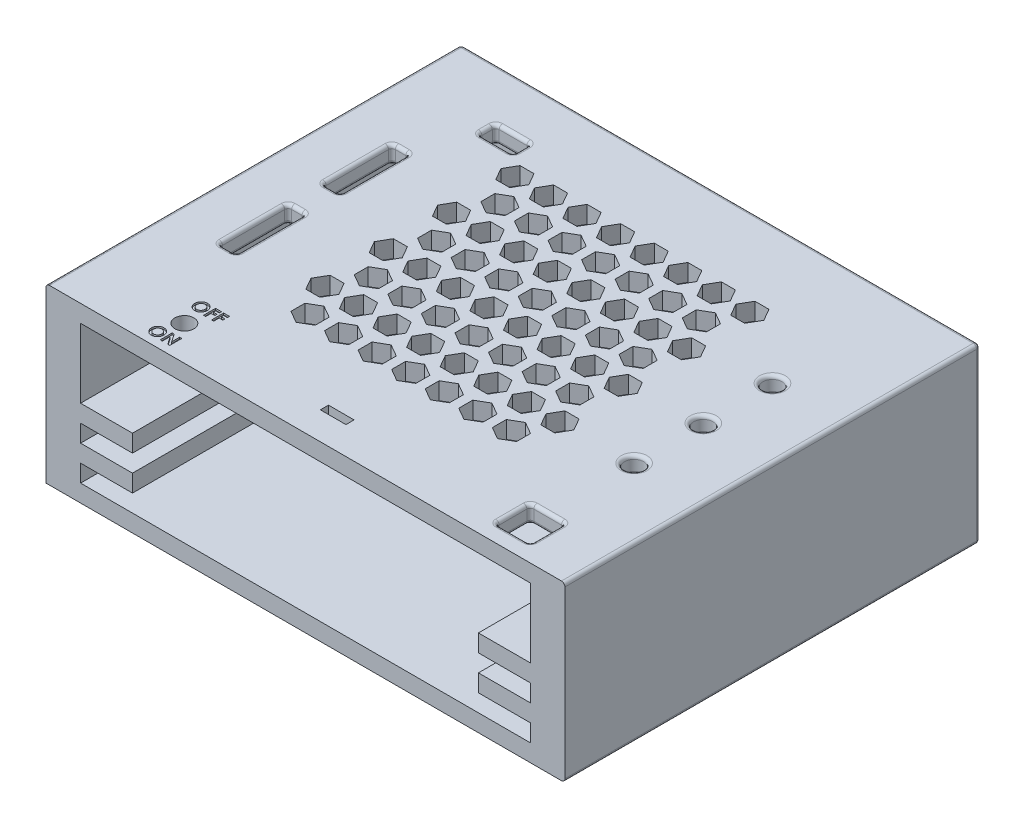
from build123d import *

# Parameters (mm, degrees)
SKETCH1_W           = 150
SKETCH1_H           = 120
BOSS_EXTRUDE1_DEPTH = 50
SKETCH8_W           = 130
SKETCH8_H           = 40
CUT_EXTRUDE5_DEPTH  = 110
BOSS_EXTRUDE2_REACH = 152.083
SKETCH3_W           = 15
SKETCH3_H           = 5
CUT_EXTRUDE1_REACH  = 110.282
SKETCH4_R           = 2.75
SKETCH4_W           = 5
SKETCH4_H           = 20
SKETCH4_W_2         = 10
SKETCH4_H_2         = 10
SKETCH4_W_3         = 7.4
SKETCH4_H_3         = 2.35
SKETCH4_H_4         = 5
CUT_EXTRUDE2_DEPTH  = 0.5
CUT_EXTRUDE3_DEPTH  = 0.5
CUT_EXTRUDE6_REACH  = 110.282
LPATTERN1_COUNT     = 4
LPATTERN1_PITCH     = 18.3
FILLET1_R           = 1


with BuildPart() as part:
    # Sketch1 → Boss-Extrude1 (new body)
    with BuildSketch(Plane(origin=(0, 0, 0), x_dir=(1, 0, 0), z_dir=(0, 1, 0))):
        Rectangle(SKETCH1_W, SKETCH1_H)
    extrude(amount=BOSS_EXTRUDE1_DEPTH)

    # Sketch8 → Cut-Extrude5 (cut)
    with BuildSketch(Plane.XY.offset(60)):
        with Locations((0, 25)):
            Rectangle(SKETCH8_W, SKETCH8_H)
    extrude(amount=-CUT_EXTRUDE5_DEPTH, mode=Mode.SUBTRACT)

    # Sketch3 → Boss-Extrude2 (add, up to next)
    with BuildSketch(Plane.XY.offset(60), mode=Mode.PRIVATE) as boss_extrude2_sk1:
        with Locations((57.5, 12.5)):
            Rectangle(SKETCH3_W, SKETCH3_H)
    boss_extrude2_tool1 = extrude(boss_extrude2_sk1.sketch, amount=-BOSS_EXTRUDE2_REACH, mode=Mode.PRIVATE) - part.part
    # Sketch3 → Boss-Extrude2 (add, up to next)
    with BuildSketch(Plane.XY.offset(60), mode=Mode.PRIVATE) as boss_extrude2_sk2:
        with Locations((-57.5, 22.5)):
            Rectangle(SKETCH3_W, SKETCH3_H)
    boss_extrude2_tool2 = extrude(boss_extrude2_sk2.sketch, amount=-BOSS_EXTRUDE2_REACH, mode=Mode.PRIVATE) - part.part
    # Sketch3 → Boss-Extrude2 (add, up to next)
    with BuildSketch(Plane.XY.offset(60), mode=Mode.PRIVATE) as boss_extrude2_sk3:
        with Locations((-57.5, 12.5)):
            Rectangle(SKETCH3_W, SKETCH3_H)
    boss_extrude2_tool3 = extrude(boss_extrude2_sk3.sketch, amount=-BOSS_EXTRUDE2_REACH, mode=Mode.PRIVATE) - part.part
    # Sketch3 → Boss-Extrude2 (add, up to next)
    with BuildSketch(Plane.XY.offset(60), mode=Mode.PRIVATE) as boss_extrude2_sk4:
        with Locations((57.5, 22.5)):
            Rectangle(SKETCH3_W, SKETCH3_H)
    boss_extrude2_tool4 = extrude(boss_extrude2_sk4.sketch, amount=-BOSS_EXTRUDE2_REACH, mode=Mode.PRIVATE) - part.part
    add(boss_extrude2_tool1.solids().sort_by_distance((57.5, 12.5, 60))[0])
    add(boss_extrude2_tool2.solids().sort_by_distance((-57.5, 22.5, 60))[0])
    add(boss_extrude2_tool3.solids().sort_by_distance((-57.5, 12.5, 60))[0])
    add(boss_extrude2_tool4.solids().sort_by_distance((57.5, 22.5, 60))[0])

    # Sketch4 → Cut-Extrude1 (cut, up to next)
    with BuildSketch(Plane(origin=(0, 50, 0), x_dir=(1, 0, 0), z_dir=(0, 1, 0)), mode=Mode.PRIVATE) as cut_extrude1_sk1:
        with Locations(Location((-45, -50, 0), (0, 0, 270))):
            Circle(SKETCH4_R)
    cut_extrude1_tool1 = extrude(cut_extrude1_sk1.sketch, amount=-CUT_EXTRUDE1_REACH, mode=Mode.PRIVATE) & part.part
    # Sketch4 → Cut-Extrude1 (cut, up to next)
    with BuildSketch(Plane(origin=(0, 50, 0), x_dir=(1, 0, 0), z_dir=(0, 1, 0)), mode=Mode.PRIVATE) as cut_extrude1_sk2:
        with Locations(Location((55, 0, 0), (0, 0, 270))):
            Circle(SKETCH4_R)
    cut_extrude1_tool2 = extrude(cut_extrude1_sk2.sketch, amount=-CUT_EXTRUDE1_REACH, mode=Mode.PRIVATE) & part.part
    # Sketch4 → Cut-Extrude1 (cut, up to next)
    with BuildSketch(Plane(origin=(0, 50, 0), x_dir=(1, 0, 0), z_dir=(0, 1, 0)), mode=Mode.PRIVATE) as cut_extrude1_sk3:
        with Locations(Location((55, -20, 0), (0, 0, 270))):
            Circle(SKETCH4_R)
    cut_extrude1_tool3 = extrude(cut_extrude1_sk3.sketch, amount=-CUT_EXTRUDE1_REACH, mode=Mode.PRIVATE) & part.part
    # Sketch4 → Cut-Extrude1 (cut, up to next)
    with BuildSketch(Plane(origin=(0, 50, 0), x_dir=(1, 0, 0), z_dir=(0, 1, 0)), mode=Mode.PRIVATE) as cut_extrude1_sk4:
        with Locations(Location((55, 20, 0), (0, 0, 270))):
            Circle(SKETCH4_R)
    cut_extrude1_tool4 = extrude(cut_extrude1_sk4.sketch, amount=-CUT_EXTRUDE1_REACH, mode=Mode.PRIVATE) & part.part
    # Sketch4 → Cut-Extrude1 (cut, up to next)
    with BuildSketch(Plane(origin=(0, 50, 0), x_dir=(1, 0, 0), z_dir=(0, 1, 0)), mode=Mode.PRIVATE) as cut_extrude1_sk5:
        with Locations((-57.5, 15)):
            Rectangle(SKETCH4_W, SKETCH4_H)
    cut_extrude1_tool5 = extrude(cut_extrude1_sk5.sketch, amount=-CUT_EXTRUDE1_REACH, mode=Mode.PRIVATE) & part.part
    # Sketch4 → Cut-Extrude1 (cut, up to next)
    with BuildSketch(Plane(origin=(0, 50, 0), x_dir=(1, 0, 0), z_dir=(0, 1, 0)), mode=Mode.PRIVATE) as cut_extrude1_sk6:
        with Locations((55, -50)):
            Rectangle(SKETCH4_W_2, SKETCH4_H_2)
    cut_extrude1_tool6 = extrude(cut_extrude1_sk6.sketch, amount=-CUT_EXTRUDE1_REACH, mode=Mode.PRIVATE) & part.part
    # Sketch4 → Cut-Extrude1 (cut, up to next)
    with BuildSketch(Plane(origin=(0, 50, 0), x_dir=(1, 0, 0), z_dir=(0, 1, 0)), mode=Mode.PRIVATE) as cut_extrude1_sk7:
        with Locations((0, -50.825)):
            Rectangle(SKETCH4_W_3, SKETCH4_H_3)
    cut_extrude1_tool7 = extrude(cut_extrude1_sk7.sketch, amount=-CUT_EXTRUDE1_REACH, mode=Mode.PRIVATE) & part.part
    # Sketch4 → Cut-Extrude1 (cut, up to next)
    with BuildSketch(Plane(origin=(0, 50, 0), x_dir=(1, 0, 0), z_dir=(0, 1, 0)), mode=Mode.PRIVATE) as cut_extrude1_sk8:
        with Locations((-57.5, -15)):
            Rectangle(SKETCH4_W, SKETCH4_H)
    cut_extrude1_tool8 = extrude(cut_extrude1_sk8.sketch, amount=-CUT_EXTRUDE1_REACH, mode=Mode.PRIVATE) & part.part
    # Sketch4 → Cut-Extrude1 (cut, up to next)
    with BuildSketch(Plane(origin=(0, 50, 0), x_dir=(1, 0, 0), z_dir=(0, 1, 0)), mode=Mode.PRIVATE) as cut_extrude1_sk9:
        with Locations((-45, 42.5)):
            Rectangle(SKETCH4_W_2, SKETCH4_H_4)
    cut_extrude1_tool9 = extrude(cut_extrude1_sk9.sketch, amount=-CUT_EXTRUDE1_REACH, mode=Mode.PRIVATE) & part.part
    add(cut_extrude1_tool1.solids().sort_by_distance((-45, 50, 50))[0], mode=Mode.SUBTRACT)
    add(cut_extrude1_tool2.solids().sort_by_distance((55, 50, 0))[0], mode=Mode.SUBTRACT)
    add(cut_extrude1_tool3.solids().sort_by_distance((55, 50, 20))[0], mode=Mode.SUBTRACT)
    add(cut_extrude1_tool4.solids().sort_by_distance((55, 50, -20))[0], mode=Mode.SUBTRACT)
    add(cut_extrude1_tool5.solids().sort_by_distance((-57.5, 50, -15))[0], mode=Mode.SUBTRACT)
    add(cut_extrude1_tool6.solids().sort_by_distance((55, 50, 50))[0], mode=Mode.SUBTRACT)
    add(cut_extrude1_tool7.solids().sort_by_distance((0, 50, 50.825))[0], mode=Mode.SUBTRACT)
    add(cut_extrude1_tool8.solids().sort_by_distance((-57.5, 50, 15))[0], mode=Mode.SUBTRACT)
    add(cut_extrude1_tool9.solids().sort_by_distance((-45, 50, -42.5))[0], mode=Mode.SUBTRACT)

    # Sketch5 → Cut-Extrude2 (cut)
    # profile 1 of 2: a face of its own
    with BuildSketch(Plane(origin=(0, 50, 0), x_dir=(1, 0, 0), z_dir=(0, 1, 0))):
        with BuildLine():
            add(Edge.make_bspline(
                [(-46.80393132, -54.056589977), (-46.74307953, -54.058165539), (-46.622944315, -54.061276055), (-46.446268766, -54.087204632), (-46.276009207, -54.129451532), (-46.11224263, -54.188177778), (-45.955379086, -54.264973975), (-45.804865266, -54.357662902), (-45.661240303, -54.467994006), (-45.525975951, -54.593393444), (-45.400967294, -54.729759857), (-45.29264722, -54.876582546), (-45.200275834, -55.030057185), (-45.123718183, -55.190595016), (-45.065405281, -55.359307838), (-45.024484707, -55.535335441), (-44.998195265, -55.718627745), (-44.995171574, -55.843424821), (-44.993634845, -55.906850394)],
                knots=[0, 0, 0, 0, 1.014329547, 2.002516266, 2.970391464, 3.935626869, 4.897733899, 5.877609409, 6.878433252, 7.912639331, 8.949961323, 9.958554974, 10.949718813, 11.932905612, 12.9188844, 13.919928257, 14.942845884, 16, 16, 16, 16], degree=3))
            add(Edge.make_bspline(
                [(-44.993634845, -55.906850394), (-44.995271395, -55.969561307), (-44.998496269, -56.093135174), (-45.023411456, -56.274738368), (-45.065021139, -56.448880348), (-45.122345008, -56.615955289), (-45.197514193, -56.775153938), (-45.288084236, -56.927492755), (-45.396445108, -57.071558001), (-45.518644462, -57.207272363), (-45.653175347, -57.330462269), (-45.79566491, -57.43902316), (-45.945455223, -57.531013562), (-46.102327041, -57.60639134), (-46.266616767, -57.664889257), (-46.437918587, -57.706163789), (-46.616221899, -57.731247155), (-46.737476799, -57.734450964), (-46.799023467, -57.736077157)],
                knots=[0, 0, 0, 0, 1.051557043, 2.072126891, 3.067553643, 4.050577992, 5.02905126, 6.015227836, 7.017913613, 8.04756643, 9.074058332, 10.072836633, 11.047628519, 12.017157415, 12.98668631, 13.966869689, 14.968021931, 16, 16, 16, 16], degree=3))
            add(Edge.make_bspline(
                [(-46.799023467, -57.736077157), (-46.863393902, -57.734618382), (-46.989873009, -57.731752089), (-47.174975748, -57.704494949), (-47.352320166, -57.663436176), (-47.520416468, -57.602158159), (-47.680976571, -57.525555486), (-47.832820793, -57.4312147), (-47.975898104, -57.319291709), (-48.10938779, -57.192652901), (-48.230329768, -57.054082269), (-48.337084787, -56.907694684), (-48.427135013, -56.75460842), (-48.500483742, -56.594751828), (-48.558308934, -56.429118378), (-48.599098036, -56.256699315), (-48.623193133, -56.077908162), (-48.62654944, -55.956469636), (-48.62825023, -55.894931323)],
                knots=[0, 0, 0, 0, 1.067978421, 2.098431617, 3.099715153, 4.085208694, 5.062210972, 6.048429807, 7.046490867, 8.072918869, 9.098532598, 10.095778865, 11.076610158, 12.041847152, 13.011192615, 13.984257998, 14.978533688, 16, 16, 16, 16], degree=3))
            add(Edge.make_bspline(
                [(-48.62825023, -55.894931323), (-48.627716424, -55.853531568), (-48.626655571, -55.771256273), (-48.613876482, -55.649328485), (-48.595478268, -55.529780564), (-48.568268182, -55.413089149), (-48.535214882, -55.298431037), (-48.492389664, -55.186873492), (-48.443642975, -55.077224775), (-48.386687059, -54.970779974), (-48.323357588, -54.86851847), (-48.254259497, -54.770922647), (-48.179219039, -54.679172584), (-48.098477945, -54.592665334), (-48.011757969, -54.511969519), (-47.920199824, -54.435942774), (-47.822027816, -54.366604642), (-47.71939062, -54.302261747), (-47.612866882, -54.244077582), (-47.50289025, -54.194552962), (-47.39172646, -54.151303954), (-47.277890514, -54.117169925), (-47.162602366, -54.089368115), (-47.044630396, -54.070982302), (-46.925040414, -54.058203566), (-46.844396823, -54.057129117), (-46.80393132, -54.056589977)],
                knots=[0, 0, 0, 0, 1.034744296, 2.056386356, 3.06226378, 4.057406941, 5.050368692, 6.043467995, 7.042652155, 8.049140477, 9.059438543, 10.048523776, 11.036952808, 12.020949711, 13.004946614, 13.997082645, 14.994316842, 16.007702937, 17.024872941, 18.026463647, 19.021641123, 20.005082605, 20.995858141, 21.984425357, 22.988620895, 24, 24, 24, 24], degree=3))
        make_face()
        with BuildLine():
            add(Edge.make_bspline(
                [(-46.813747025, -54.684795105), (-46.854700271, -54.685893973), (-46.935525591, -54.688062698), (-47.054081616, -54.704585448), (-47.167899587, -54.730974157), (-47.276348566, -54.76919788), (-47.379898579, -54.817846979), (-47.47873319, -54.876751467), (-47.571483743, -54.94793612), (-47.659386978, -55.027579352), (-47.738793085, -55.116320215), (-47.808950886, -55.211421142), (-47.867661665, -55.312723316), (-47.916832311, -55.419285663), (-47.953846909, -55.532306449), (-47.980211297, -55.65090037), (-47.996872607, -55.775271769), (-47.998972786, -55.860055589), (-48.000045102, -55.903344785)],
                knots=[0, 0, 0, 0, 1.033739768, 2.040188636, 3.016340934, 3.979330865, 4.937572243, 5.900995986, 6.878200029, 7.884839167, 8.891893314, 9.879764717, 10.863503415, 11.843163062, 12.837761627, 13.859916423, 14.907309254, 16, 16, 16, 16], degree=3))
            add(Edge.make_bspline(
                [(-48.000045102, -55.903344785), (-47.998623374, -55.951318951), (-47.995837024, -56.045340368), (-47.976231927, -56.182496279), (-47.942689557, -56.312026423), (-47.894255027, -56.433297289), (-47.834183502, -56.547655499), (-47.759584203, -56.653699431), (-47.671665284, -56.752064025), (-47.603933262, -56.809493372), (-47.56955632, -56.838641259)],
                knots=[0, 0, 0, 0, 1.078454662, 2.113592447, 3.107694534, 4.079536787, 5.043276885, 6.005368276, 6.987637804, 8, 8, 8, 8], degree=3))
            add(Edge.make_bspline(
                [(-47.56955632, -56.838641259), (-47.541395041, -56.860174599), (-47.485706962, -56.902756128), (-47.396816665, -56.957333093), (-47.305277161, -57.004110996), (-47.210397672, -57.041906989), (-47.112378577, -57.071636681), (-47.011233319, -57.092455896), (-46.90710521, -57.105521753), (-46.836688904, -57.107083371), (-46.801126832, -57.107872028)],
                knots=[0, 0, 0, 0, 1.023928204, 2.024787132, 3.009472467, 3.9914905, 4.972207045, 5.96565515, 6.972602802, 8, 8, 8, 8], degree=3))
            add(Edge.make_bspline(
                [(-46.801126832, -57.107872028), (-46.760877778, -57.106763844), (-46.681686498, -57.104583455), (-46.565337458, -57.08826411), (-46.453871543, -57.060645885), (-46.346596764, -57.022757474), (-46.243822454, -56.973497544), (-46.146050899, -56.912766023), (-46.053110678, -56.841308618), (-45.965319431, -56.760619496), (-45.885074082, -56.671529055), (-45.815062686, -56.575920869), (-45.754485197, -56.475901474), (-45.706337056, -56.370055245), (-45.667860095, -56.259381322), (-45.641813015, -56.143389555), (-45.625010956, -56.022558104), (-45.622910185, -55.940328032), (-45.621839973, -55.898436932)],
                knots=[0, 0, 0, 0, 1.026359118, 2.019393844, 2.989460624, 3.950973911, 4.916101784, 5.890408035, 6.881132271, 7.902007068, 8.92769091, 9.933912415, 10.920395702, 11.90457117, 12.894218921, 13.903490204, 14.931958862, 16, 16, 16, 16], degree=3))
            add(Edge.make_bspline(
                [(-45.621839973, -55.898436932), (-45.622947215, -55.856786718), (-45.62512665, -55.774804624), (-45.641474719, -55.654283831), (-45.668917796, -55.538804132), (-45.706919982, -55.42817694), (-45.755446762, -55.322293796), (-45.815455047, -55.22152705), (-45.886734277, -55.125974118), (-45.967643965, -55.036286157), (-46.055709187, -54.953868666), (-46.150256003, -54.882345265), (-46.248638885, -54.820193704), (-46.353115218, -54.771506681), (-46.461547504, -54.732717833), (-46.574597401, -54.704153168), (-46.692693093, -54.688178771), (-46.773036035, -54.685933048), (-46.813747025, -54.684795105)],
                knots=[0, 0, 0, 0, 1.055025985, 2.07665775, 3.074803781, 4.057872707, 5.035505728, 6.020516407, 7.023567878, 8.050795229, 9.077271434, 10.074415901, 11.050397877, 12.019801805, 12.988065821, 13.964604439, 14.968634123, 16, 16, 16, 16], degree=3))
        make_face(mode=Mode.SUBTRACT)
    # profile 2 of 2: a face of its own
    with BuildSketch(Plane(origin=(0, 50, 0), x_dir=(1, 0, 0), z_dir=(0, 1, 0))):
        Polygon((-44.365429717, -54.146333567), (-43.799624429, -54.146333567), (-42.211583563, -56.449518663), (-42.211583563, -54.146333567), (-41.583378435, -54.146333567), (-41.583378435, -57.646333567), (-42.153390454, -57.646333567), (-43.737224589, -55.350159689), (-43.737224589, -57.646333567), (-44.365429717, -57.646333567), align=None)
    extrude(amount=-CUT_EXTRUDE2_DEPTH, mode=Mode.SUBTRACT)

    # Sketch6 → Cut-Extrude3 (cut)
    # profile 1 of 3: a face of its own
    with BuildSketch(Plane(origin=(0, 50, 0), x_dir=(1, 0, 0), z_dir=(0, 1, 0))):
        with BuildLine():
            add(Edge.make_bspline(
                [(-46.689313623, -41.639672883), (-46.628461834, -41.641248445), (-46.508326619, -41.64435896), (-46.33165107, -41.670287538), (-46.161391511, -41.712534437), (-45.997624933, -41.771260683), (-45.84076139, -41.848056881), (-45.69024757, -41.940745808), (-45.546622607, -42.051076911), (-45.411358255, -42.17647635), (-45.286349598, -42.312842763), (-45.178029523, -42.459665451), (-45.085658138, -42.613140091), (-45.009100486, -42.773677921), (-44.950787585, -42.942390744), (-44.90986701, -43.118418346), (-44.883577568, -43.30171065), (-44.880553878, -43.426507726), (-44.879017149, -43.489933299)],
                knots=[0, 0, 0, 0, 1.014329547, 2.002516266, 2.970391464, 3.935626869, 4.897733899, 5.877609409, 6.878433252, 7.912639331, 8.949961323, 9.958554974, 10.949718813, 11.932905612, 12.9188844, 13.919928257, 14.942845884, 16, 16, 16, 16], degree=3))
            add(Edge.make_bspline(
                [(-44.879017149, -43.489933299), (-44.880653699, -43.552644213), (-44.883878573, -43.67621808), (-44.90879376, -43.857821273), (-44.950403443, -44.031963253), (-45.007727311, -44.199038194), (-45.082896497, -44.358236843), (-45.173466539, -44.510575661), (-45.281827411, -44.654640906), (-45.404026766, -44.790355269), (-45.53855765, -44.913545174), (-45.681047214, -45.022106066), (-45.830837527, -45.114096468), (-45.987709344, -45.189474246), (-46.151999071, -45.247972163), (-46.323300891, -45.289246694), (-46.501604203, -45.31433006), (-46.622859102, -45.31753387), (-46.684405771, -45.319160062)],
                knots=[0, 0, 0, 0, 1.051557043, 2.072126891, 3.067553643, 4.050577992, 5.02905126, 6.015227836, 7.017913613, 8.04756643, 9.074058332, 10.072836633, 11.047628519, 12.017157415, 12.98668631, 13.966869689, 14.968021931, 16, 16, 16, 16], degree=3))
            add(Edge.make_bspline(
                [(-46.684405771, -45.319160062), (-46.748776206, -45.317701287), (-46.875255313, -45.314834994), (-47.060358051, -45.287577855), (-47.237702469, -45.246519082), (-47.405798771, -45.185241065), (-47.566358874, -45.108638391), (-47.718203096, -45.014297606), (-47.861280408, -44.902374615), (-47.994770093, -44.775735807), (-48.115712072, -44.637165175), (-48.222467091, -44.49077759), (-48.312517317, -44.337691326), (-48.385866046, -44.177834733), (-48.443691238, -44.012201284), (-48.48448034, -43.83978222), (-48.508575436, -43.660991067), (-48.511931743, -43.539552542), (-48.513632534, -43.478014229)],
                knots=[0, 0, 0, 0, 1.067978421, 2.098431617, 3.099715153, 4.085208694, 5.062210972, 6.048429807, 7.046490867, 8.072918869, 9.098532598, 10.095778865, 11.076610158, 12.041847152, 13.011192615, 13.984257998, 14.978533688, 16, 16, 16, 16], degree=3))
            add(Edge.make_bspline(
                [(-48.513632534, -43.478014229), (-48.513098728, -43.436614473), (-48.512037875, -43.354339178), (-48.499258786, -43.232411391), (-48.480860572, -43.11286347), (-48.453650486, -42.996172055), (-48.420597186, -42.881513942), (-48.377771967, -42.769956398), (-48.329025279, -42.660307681), (-48.272069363, -42.55386288), (-48.208739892, -42.451601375), (-48.139641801, -42.354005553), (-48.064601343, -42.262255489), (-47.983860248, -42.17574824), (-47.897140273, -42.095052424), (-47.805582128, -42.01902568), (-47.707410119, -41.949687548), (-47.604772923, -41.885344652), (-47.498249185, -41.827160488), (-47.388272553, -41.777635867), (-47.277108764, -41.73438686), (-47.163272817, -41.700252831), (-47.04798467, -41.672451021), (-46.9300127, -41.654065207), (-46.810422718, -41.641286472), (-46.729779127, -41.640212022), (-46.689313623, -41.639672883)],
                knots=[0, 0, 0, 0, 1.034744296, 2.056386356, 3.06226378, 4.057406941, 5.050368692, 6.043467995, 7.042652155, 8.049140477, 9.059438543, 10.048523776, 11.036952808, 12.020949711, 13.004946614, 13.997082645, 14.994316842, 16.007702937, 17.024872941, 18.026463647, 19.021641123, 20.005082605, 20.995858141, 21.984425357, 22.988620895, 24, 24, 24, 24], degree=3))
        make_face()
        with BuildLine():
            add(Edge.make_bspline(
                [(-46.699129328, -42.267878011), (-46.740082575, -42.268976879), (-46.820907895, -42.271145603), (-46.93946392, -42.287668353), (-47.053281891, -42.314057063), (-47.161730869, -42.352280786), (-47.265280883, -42.400929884), (-47.364115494, -42.459834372), (-47.456866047, -42.531019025), (-47.544769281, -42.610662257), (-47.624175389, -42.69940312), (-47.69433319, -42.794504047), (-47.753043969, -42.895806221), (-47.802214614, -43.002368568), (-47.839229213, -43.115389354), (-47.865593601, -43.233983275), (-47.882254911, -43.358354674), (-47.884355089, -43.443138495), (-47.885427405, -43.486427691)],
                knots=[0, 0, 0, 0, 1.033739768, 2.040188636, 3.016340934, 3.979330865, 4.937572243, 5.900995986, 6.878200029, 7.884839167, 8.891893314, 9.879764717, 10.863503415, 11.843163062, 12.837761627, 13.859916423, 14.907309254, 16, 16, 16, 16], degree=3))
            add(Edge.make_bspline(
                [(-47.885427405, -43.486427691), (-47.884005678, -43.534401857), (-47.881219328, -43.628423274), (-47.861614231, -43.765579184), (-47.828071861, -43.895109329), (-47.779637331, -44.016380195), (-47.719565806, -44.130738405), (-47.644966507, -44.236782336), (-47.557047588, -44.33514693), (-47.489315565, -44.392576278), (-47.454938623, -44.421724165)],
                knots=[0, 0, 0, 0, 1.078454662, 2.113592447, 3.107694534, 4.079536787, 5.043276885, 6.005368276, 6.987637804, 8, 8, 8, 8], degree=3))
            add(Edge.make_bspline(
                [(-47.454938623, -44.421724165), (-47.426777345, -44.443257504), (-47.371089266, -44.485839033), (-47.282198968, -44.540415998), (-47.190659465, -44.587193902), (-47.095779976, -44.624989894), (-46.997760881, -44.654719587), (-46.896615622, -44.675538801), (-46.792487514, -44.688604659), (-46.722071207, -44.690166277), (-46.686509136, -44.690954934)],
                knots=[0, 0, 0, 0, 1.023928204, 2.024787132, 3.009472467, 3.9914905, 4.972207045, 5.96565515, 6.972602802, 8, 8, 8, 8], degree=3))
            add(Edge.make_bspline(
                [(-46.686509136, -44.690954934), (-46.646260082, -44.689846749), (-46.567068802, -44.687666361), (-46.450719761, -44.671347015), (-46.339253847, -44.64372879), (-46.231979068, -44.605840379), (-46.129204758, -44.556580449), (-46.031433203, -44.495848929), (-45.938492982, -44.424391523), (-45.850701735, -44.343702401), (-45.770456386, -44.25461196), (-45.70044499, -44.159003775), (-45.639867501, -44.058984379), (-45.59171936, -43.953138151), (-45.553242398, -43.842464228), (-45.527195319, -43.72647246), (-45.510393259, -43.60564101), (-45.508292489, -43.523410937), (-45.507222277, -43.481519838)],
                knots=[0, 0, 0, 0, 1.026359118, 2.019393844, 2.989460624, 3.950973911, 4.916101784, 5.890408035, 6.881132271, 7.902007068, 8.92769091, 9.933912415, 10.920395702, 11.90457117, 12.894218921, 13.903490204, 14.931958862, 16, 16, 16, 16], degree=3))
            add(Edge.make_bspline(
                [(-45.507222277, -43.481519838), (-45.508329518, -43.439869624), (-45.510508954, -43.35788753), (-45.526857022, -43.237366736), (-45.5543001, -43.121887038), (-45.592302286, -43.011259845), (-45.640829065, -42.905376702), (-45.700837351, -42.804609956), (-45.772116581, -42.709057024), (-45.853026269, -42.619369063), (-45.941091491, -42.536951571), (-46.035638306, -42.465428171), (-46.134021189, -42.40327661), (-46.238497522, -42.354589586), (-46.346929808, -42.315800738), (-46.459979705, -42.287236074), (-46.578075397, -42.271261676), (-46.658418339, -42.269015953), (-46.699129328, -42.267878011)],
                knots=[0, 0, 0, 0, 1.055025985, 2.07665775, 3.074803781, 4.057872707, 5.035505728, 6.020516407, 7.023567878, 8.050795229, 9.077271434, 10.074415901, 11.050397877, 12.019801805, 12.988065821, 13.964604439, 14.968634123, 16, 16, 16, 16], degree=3))
        make_face(mode=Mode.SUBTRACT)
    # profile 2 of 3: a face of its own
    with BuildSketch(Plane(origin=(0, 50, 0), x_dir=(1, 0, 0), z_dir=(0, 1, 0))):
        Polygon((-44.250812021, -41.729416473), (-42.545683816, -41.729416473), (-42.545683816, -42.357621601), (-43.622606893, -42.357621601), (-43.622606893, -43.030698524), (-42.545683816, -43.030698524), (-42.545683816, -43.658903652), (-43.622606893, -43.658903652), (-43.622606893, -45.229416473), (-44.250812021, -45.229416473), align=None)
    # profile 3 of 3: a face of its own
    with BuildSketch(Plane(origin=(0, 50, 0), x_dir=(1, 0, 0), z_dir=(0, 1, 0))):
        Polygon((-41.917478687, -41.729416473), (-40.212350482, -41.729416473), (-40.212350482, -42.357621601), (-41.289273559, -42.357621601), (-41.289273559, -43.030698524), (-40.212350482, -43.030698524), (-40.212350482, -43.658903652), (-41.289273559, -43.658903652), (-41.289273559, -45.229416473), (-41.917478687, -45.229416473), align=None)
    extrude(amount=-CUT_EXTRUDE3_DEPTH, mode=Mode.SUBTRACT)

    # Sketch9 → Cut-Extrude6 (cut, up to next)
    with BuildSketch(Plane(origin=(0, 50, 0), x_dir=(1, 0, 0), z_dir=(0, 1, 0)), mode=Mode.PRIVATE) as cut_extrude6_sk1:
        Polygon((-20.214653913, 34.5), (-22.235379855, 38), (-26.276831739, 38), (-28.297557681, 34.5), (-26.276831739, 31), (-22.235379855, 31), align=None)
    cut_extrude6_tool1 = extrude(cut_extrude6_sk1.sketch, amount=-CUT_EXTRUDE6_REACH, mode=Mode.PRIVATE) & part.part
    # Sketch9 → Cut-Extrude6 (cut, up to next)
    with BuildSketch(Plane(origin=(0, 50, 0), x_dir=(1, 0, 0), z_dir=(0, 1, 0)), mode=Mode.PRIVATE) as cut_extrude6_sk2:
        Polygon((-29.917096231, 34.5), (-31.937822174, 38), (-35.979274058, 38), (-38, 34.5), (-35.979274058, 31), (-31.937822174, 31), align=None)
    cut_extrude6_tool2 = extrude(cut_extrude6_sk2.sketch, amount=-CUT_EXTRUDE6_REACH, mode=Mode.PRIVATE) & part.part
    # Sketch9 → Cut-Extrude6 (cut, up to next)
    with BuildSketch(Plane(origin=(0, 50, 0), x_dir=(1, 0, 0), z_dir=(0, 1, 0)), mode=Mode.PRIVATE) as cut_extrude6_sk3:
        Polygon((-10.512211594, 34.5), (-12.532937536, 38), (-16.57438942, 38), (-18.595115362, 34.5), (-16.57438942, 31), (-12.532937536, 31), align=None)
    cut_extrude6_tool3 = extrude(cut_extrude6_sk3.sketch, amount=-CUT_EXTRUDE6_REACH, mode=Mode.PRIVATE) & part.part
    # Sketch9 → Cut-Extrude6 (cut, up to next)
    with BuildSketch(Plane(origin=(0, 50, 0), x_dir=(1, 0, 0), z_dir=(0, 1, 0)), mode=Mode.PRIVATE) as cut_extrude6_sk4:
        Polygon((-0.809769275, 34.5), (-2.830495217, 38), (-6.871947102, 38), (-8.892673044, 34.5), (-6.871947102, 31), (-2.830495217, 31), align=None)
    cut_extrude6_tool4 = extrude(cut_extrude6_sk4.sketch, amount=-CUT_EXTRUDE6_REACH, mode=Mode.PRIVATE) & part.part
    # Sketch9 → Cut-Extrude6 (cut, up to next)
    with BuildSketch(Plane(origin=(0, 50, 0), x_dir=(1, 0, 0), z_dir=(0, 1, 0)), mode=Mode.PRIVATE) as cut_extrude6_sk5:
        Polygon((8.892673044, 34.5), (6.871947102, 38), (2.830495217, 38), (0.809769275, 34.5), (2.830495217, 31), (6.871947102, 31), align=None)
    cut_extrude6_tool5 = extrude(cut_extrude6_sk5.sketch, amount=-CUT_EXTRUDE6_REACH, mode=Mode.PRIVATE) & part.part
    # Sketch9 → Cut-Extrude6 (cut, up to next)
    with BuildSketch(Plane(origin=(0, 50, 0), x_dir=(1, 0, 0), z_dir=(0, 1, 0)), mode=Mode.PRIVATE) as cut_extrude6_sk6:
        Polygon((18.595115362, 34.5), (16.57438942, 38), (12.532937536, 38), (10.512211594, 34.5), (12.532937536, 31), (16.57438942, 31), align=None)
    cut_extrude6_tool6 = extrude(cut_extrude6_sk6.sketch, amount=-CUT_EXTRUDE6_REACH, mode=Mode.PRIVATE) & part.part
    # Sketch9 → Cut-Extrude6 (cut, up to next)
    with BuildSketch(Plane(origin=(0, 50, 0), x_dir=(1, 0, 0), z_dir=(0, 1, 0)), mode=Mode.PRIVATE) as cut_extrude6_sk7:
        Polygon((28.297557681, 34.5), (26.276831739, 38), (22.235379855, 38), (20.214653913, 34.5), (22.235379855, 31), (26.276831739, 31), align=None)
    cut_extrude6_tool7 = extrude(cut_extrude6_sk7.sketch, amount=-CUT_EXTRUDE6_REACH, mode=Mode.PRIVATE) & part.part
    # Sketch9 → Cut-Extrude6 (cut, up to next)
    with BuildSketch(Plane(origin=(0, 50, 0), x_dir=(1, 0, 0), z_dir=(0, 1, 0)), mode=Mode.PRIVATE) as cut_extrude6_sk8:
        Polygon((38, 34.5), (35.979274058, 38), (31.937822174, 38), (29.917096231, 34.5), (31.937822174, 31), (35.979274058, 31), align=None)
    cut_extrude6_tool8 = extrude(cut_extrude6_sk8.sketch, amount=-CUT_EXTRUDE6_REACH, mode=Mode.PRIVATE) & part.part
    # Sketch9 → Cut-Extrude6 (cut, up to next)
    with BuildSketch(Plane(origin=(0, 50, 0), x_dir=(1, 0, 0), z_dir=(0, 1, 0)), mode=Mode.PRIVATE) as cut_extrude6_sk9:
        Polygon((-29.107326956, 29.38), (-32.607326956, 27.359274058), (-32.607326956, 23.317822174), (-29.107326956, 21.297096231), (-25.607326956, 23.317822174), (-25.607326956, 27.359274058), align=None)
    cut_extrude6_tool9 = extrude(cut_extrude6_sk9.sketch, amount=-CUT_EXTRUDE6_REACH, mode=Mode.PRIVATE) & part.part
    # Sketch9 → Cut-Extrude6 (cut, up to next)
    with BuildSketch(Plane(origin=(0, 50, 0), x_dir=(1, 0, 0), z_dir=(0, 1, 0)), mode=Mode.PRIVATE) as cut_extrude6_sk10:
        Polygon((-19.404884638, 29.38), (-22.904884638, 27.359274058), (-22.904884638, 23.317822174), (-19.404884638, 21.297096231), (-15.904884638, 23.317822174), (-15.904884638, 27.359274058), align=None)
    cut_extrude6_tool10 = extrude(cut_extrude6_sk10.sketch, amount=-CUT_EXTRUDE6_REACH, mode=Mode.PRIVATE) & part.part
    # Sketch9 → Cut-Extrude6 (cut, up to next)
    with BuildSketch(Plane(origin=(0, 50, 0), x_dir=(1, 0, 0), z_dir=(0, 1, 0)), mode=Mode.PRIVATE) as cut_extrude6_sk11:
        Polygon((-9.702442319, 29.38), (-13.202442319, 27.359274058), (-13.202442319, 23.317822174), (-9.702442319, 21.297096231), (-6.202442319, 23.317822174), (-6.202442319, 27.359274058), align=None)
    cut_extrude6_tool11 = extrude(cut_extrude6_sk11.sketch, amount=-CUT_EXTRUDE6_REACH, mode=Mode.PRIVATE) & part.part
    # Sketch9 → Cut-Extrude6 (cut, up to next)
    with BuildSketch(Plane(origin=(0, 50, 0), x_dir=(1, 0, 0), z_dir=(0, 1, 0)), mode=Mode.PRIVATE) as cut_extrude6_sk12:
        Polygon((0, 29.38), (-3.5, 27.359274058), (-3.5, 23.317822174), (0, 21.297096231), (3.5, 23.317822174), (3.5, 27.359274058), align=None)
    cut_extrude6_tool12 = extrude(cut_extrude6_sk12.sketch, amount=-CUT_EXTRUDE6_REACH, mode=Mode.PRIVATE) & part.part
    # Sketch9 → Cut-Extrude6 (cut, up to next)
    with BuildSketch(Plane(origin=(0, 50, 0), x_dir=(1, 0, 0), z_dir=(0, 1, 0)), mode=Mode.PRIVATE) as cut_extrude6_sk13:
        Polygon((9.702442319, 29.38), (6.202442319, 27.359274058), (6.202442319, 23.317822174), (9.702442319, 21.297096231), (13.202442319, 23.317822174), (13.202442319, 27.359274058), align=None)
    cut_extrude6_tool13 = extrude(cut_extrude6_sk13.sketch, amount=-CUT_EXTRUDE6_REACH, mode=Mode.PRIVATE) & part.part
    # Sketch9 → Cut-Extrude6 (cut, up to next)
    with BuildSketch(Plane(origin=(0, 50, 0), x_dir=(1, 0, 0), z_dir=(0, 1, 0)), mode=Mode.PRIVATE) as cut_extrude6_sk14:
        Polygon((19.404884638, 29.38), (15.904884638, 27.359274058), (15.904884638, 23.317822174), (19.404884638, 21.297096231), (22.904884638, 23.317822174), (22.904884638, 27.359274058), align=None)
    cut_extrude6_tool14 = extrude(cut_extrude6_sk14.sketch, amount=-CUT_EXTRUDE6_REACH, mode=Mode.PRIVATE) & part.part
    # Sketch9 → Cut-Extrude6 (cut, up to next)
    with BuildSketch(Plane(origin=(0, 50, 0), x_dir=(1, 0, 0), z_dir=(0, 1, 0)), mode=Mode.PRIVATE) as cut_extrude6_sk15:
        Polygon((29.107326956, 29.38), (25.607326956, 27.359274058), (25.607326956, 23.317822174), (29.107326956, 21.297096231), (32.607326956, 23.317822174), (32.607326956, 27.359274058), align=None)
    cut_extrude6_tool15 = extrude(cut_extrude6_sk15.sketch, amount=-CUT_EXTRUDE6_REACH, mode=Mode.PRIVATE) & part.part
    cut_extrude6_1 = cut_extrude6_tool1.solids().sort_by_distance((-24.256106, 50, -34.5))[0]
    add(cut_extrude6_1, mode=Mode.SUBTRACT)
    cut_extrude6_2 = cut_extrude6_tool2.solids().sort_by_distance((-33.958548, 50, -34.5))[0]
    add(cut_extrude6_2, mode=Mode.SUBTRACT)
    cut_extrude6_3 = cut_extrude6_tool3.solids().sort_by_distance((-14.553663, 50, -34.5))[0]
    add(cut_extrude6_3, mode=Mode.SUBTRACT)
    cut_extrude6_4 = cut_extrude6_tool4.solids().sort_by_distance((-4.851221, 50, -34.5))[0]
    add(cut_extrude6_4, mode=Mode.SUBTRACT)
    cut_extrude6_5 = cut_extrude6_tool5.solids().sort_by_distance((4.851221, 50, -34.5))[0]
    add(cut_extrude6_5, mode=Mode.SUBTRACT)
    cut_extrude6_6 = cut_extrude6_tool6.solids().sort_by_distance((14.553663, 50, -34.5))[0]
    add(cut_extrude6_6, mode=Mode.SUBTRACT)
    cut_extrude6_7 = cut_extrude6_tool7.solids().sort_by_distance((24.256106, 50, -34.5))[0]
    add(cut_extrude6_7, mode=Mode.SUBTRACT)
    cut_extrude6_8 = cut_extrude6_tool8.solids().sort_by_distance((33.958548, 50, -34.5))[0]
    add(cut_extrude6_8, mode=Mode.SUBTRACT)
    cut_extrude6_9 = cut_extrude6_tool9.solids().sort_by_distance((-29.107327, 50, -25.338548))[0]
    add(cut_extrude6_9, mode=Mode.SUBTRACT)
    cut_extrude6_10 = cut_extrude6_tool10.solids().sort_by_distance((-19.404885, 50, -25.338548))[0]
    add(cut_extrude6_10, mode=Mode.SUBTRACT)
    cut_extrude6_11 = cut_extrude6_tool11.solids().sort_by_distance((-9.702442, 50, -25.338548))[0]
    add(cut_extrude6_11, mode=Mode.SUBTRACT)
    cut_extrude6_12 = cut_extrude6_tool12.solids().sort_by_distance((0, 50, -25.338548))[0]
    add(cut_extrude6_12, mode=Mode.SUBTRACT)
    cut_extrude6_13 = cut_extrude6_tool13.solids().sort_by_distance((9.702442, 50, -25.338548))[0]
    add(cut_extrude6_13, mode=Mode.SUBTRACT)
    cut_extrude6_14 = cut_extrude6_tool14.solids().sort_by_distance((19.404885, 50, -25.338548))[0]
    add(cut_extrude6_14, mode=Mode.SUBTRACT)
    cut_extrude6_15 = cut_extrude6_tool15.solids().sort_by_distance((29.107327, 50, -25.338548))[0]
    add(cut_extrude6_15, mode=Mode.SUBTRACT)
    cut_extrude6 = cut_extrude6_1 + cut_extrude6_2 + cut_extrude6_3 + cut_extrude6_4 + cut_extrude6_5 + cut_extrude6_6 + cut_extrude6_7 + cut_extrude6_8 + cut_extrude6_9 + cut_extrude6_10 + cut_extrude6_11 + cut_extrude6_12 + cut_extrude6_13 + cut_extrude6_14 + cut_extrude6_15  # Cut-Extrude6 as one shape, for the pattern or mirror that repeats it

    # LPattern1: Cut-Extrude6 ×4
    with Locations(*[(0, 0, i * LPATTERN1_PITCH) for i in range(1, LPATTERN1_COUNT)]):
        add(cut_extrude6, mode=Mode.SUBTRACT)

    # Fillet1
    fillet1_edges = [part.edges().sort_by_distance(p)[0] for p in [
        (-50, 50, -42.5),
        (-45, 50, -40),
        (-45, 45, -45),
        (-50, 47.5, -45),
        (-45, 50, -45),
        (-50, 47.5, -40),
        (-40, 47.5, -40),
        (-40, 45, -42.5),
        (-40, 47.5, -45),
        (-40, 50, -42.5),
        (-45, 45, -40),
        (-50, 45, -42.5),
        (55, 45, -22.75),
        (55, 50, -22.75),
        (55, 45, -2.75),
        (55, 50, -2.75),
        (55, 45, 17.25),
        (55, 50, 17.25),
        (50, 50, 50),
        (55, 50, 55),
        (-75, 50, 0),
        (55, 45, 45),
        (50, 47.5, 45),
        (55, 50, 45),
        (50, 47.5, 55),
        (60, 47.5, 55),
        (60, 45, 50),
        (60, 47.5, 45),
        (60, 50, 50),
        (55, 45, 55),
        (50, 45, 50),
        (-55, 45, 15),
        (-57.5, 45, 25),
        (-57.5, 50, 25),
        (-55, 50, 15),
        (-55, 47.5, 25),
        (-55, 47.5, 5),
        (-57.5, 45, 5),
        (-60, 47.5, 5),
        (-57.5, 50, 5),
        (-60, 45, 15),
        (-60, 47.5, 25),
        (-60, 50, 15),
        (-60, 50, -15),
        (-57.5, 50, -5),
        (-57.5, 45, -25),
        (-60, 47.5, -25),
        (-57.5, 50, -25),
        (-60, 47.5, -5),
        (-55, 47.5, -5),
        (-55, 45, -15),
        (-55, 47.5, -25),
        (-55, 50, -15),
        (-57.5, 45, -5),
        (-60, 45, -15),
        (75, 50, 0),
        (0, 0, -60),
        (75, 0, 0),
        (-75, 25, -60),
        (75, 25, -60),
        (0, 50, -60),
    ]]
    fillet(fillet1_edges, radius=FILLET1_R)


solid = part.part
